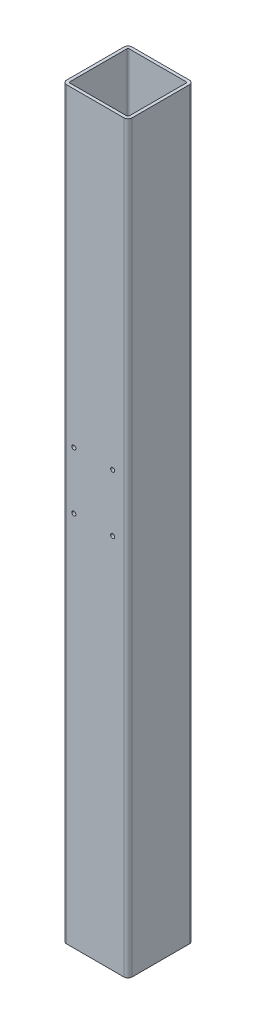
ISO-10303-21;
HEADER;
FILE_DESCRIPTION(('STEP AP214'),'2;1');
FILE_NAME('part.step','',(''),(''),'','','');
FILE_SCHEMA(('AUTOMOTIVE_DESIGN { 1 0 10303 214 1 1 1 1 }'));
ENDSEC;
DATA;
#1=APPLICATION_CONTEXT('core data for automotive mechanical design processes');
#2=APPLICATION_PROTOCOL_DEFINITION('international standard','automotive_design',2000,#1);
#3=PRODUCT_CONTEXT('',#1,'mechanical');
#4=PRODUCT('Part','Part','',(#3));
#5=PRODUCT_RELATED_PRODUCT_CATEGORY('part','',(#4));
#6=PRODUCT_DEFINITION_FORMATION('','',#4);
#7=PRODUCT_DEFINITION_CONTEXT('part definition',#1,'design');
#8=PRODUCT_DEFINITION('design','',#6,#7);
#9=PRODUCT_DEFINITION_SHAPE('','',#8);
#10=(LENGTH_UNIT() NAMED_UNIT(*) SI_UNIT(.MILLI.,.METRE.));
#11=(NAMED_UNIT(*) PLANE_ANGLE_UNIT() SI_UNIT($,.RADIAN.));
#12=(NAMED_UNIT(*) SI_UNIT($,.STERADIAN.) SOLID_ANGLE_UNIT());
#13=UNCERTAINTY_MEASURE_WITH_UNIT(LENGTH_MEASURE(1.E-05),#10,'distance_accuracy_value','');
#14=(GEOMETRIC_REPRESENTATION_CONTEXT(3) GLOBAL_UNCERTAINTY_ASSIGNED_CONTEXT((#13)) GLOBAL_UNIT_ASSIGNED_CONTEXT((#10,
#11,#12)) REPRESENTATION_CONTEXT('',''));
#15=CARTESIAN_POINT('',(0.,0.,0.));
#16=DIRECTION('',(0.,0.,1.));
#17=DIRECTION('',(1.,0.,0.));
#18=AXIS2_PLACEMENT_3D('',#15,#16,#17);
#19=CARTESIAN_POINT('',(26.9875000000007,6.7319110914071,38.1));
#20=DIRECTION('',(0.,0.,1.));
#21=DIRECTION('',(1.,0.,0.));
#22=AXIS2_PLACEMENT_3D('',#19,#20,#21);
#23=CYLINDRICAL_SURFACE('',#22,3.175);
#24=CARTESIAN_POINT('',(26.9875000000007,6.7319110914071,46.0375));
#25=DIRECTION('',(0.,0.,1.));
#26=DIRECTION('',(1.,0.,0.));
#27=AXIS2_PLACEMENT_3D('',#24,#25,#26);
#28=CIRCLE('',#27,3.175);
#29=CARTESIAN_POINT('',(30.1625000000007,6.7319110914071,46.0375));
#30=VERTEX_POINT('',#29);
#31=CARTESIAN_POINT('',(23.8125000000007,6.7319110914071,46.0375));
#32=VERTEX_POINT('',#31);
#33=EDGE_CURVE('E182',#30,#32,#28,.F.);
#34=ORIENTED_EDGE('',*,*,#33,.T.);
#35=DIRECTION('',(0.,0.,1.));
#36=VECTOR('',#35,1.);
#37=CARTESIAN_POINT('',(23.8125000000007,6.7319110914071,38.1));
#38=LINE('',#37,#36);
#39=CARTESIAN_POINT('',(23.8125000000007,6.7319110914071,50.8));
#40=VERTEX_POINT('',#39);
#41=EDGE_CURVE('E175',#32,#40,#38,.T.);
#42=ORIENTED_EDGE('',*,*,#41,.T.);
#43=CARTESIAN_POINT('',(26.9875000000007,6.7319110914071,50.8));
#44=DIRECTION('',(0.,0.,1.));
#45=DIRECTION('',(1.,0.,0.));
#46=AXIS2_PLACEMENT_3D('',#43,#44,#45);
#47=CIRCLE('',#46,3.175);
#48=CARTESIAN_POINT('',(30.1625000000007,6.7319110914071,50.8));
#49=VERTEX_POINT('',#48);
#50=EDGE_CURVE('E185',#49,#40,#47,.F.);
#51=ORIENTED_EDGE('',*,*,#50,.F.);
#52=DIRECTION('',(0.,0.,1.));
#53=VECTOR('',#52,1.);
#54=CARTESIAN_POINT('',(30.1625000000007,6.7319110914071,38.1));
#55=LINE('',#54,#53);
#56=EDGE_CURVE('E180',#49,#30,#55,.F.);
#57=ORIENTED_EDGE('',*,*,#56,.T.);
#58=EDGE_LOOP('',(#34,#42,#51,#57));
#59=FACE_BOUND('',#58,.T.);
#60=ADVANCED_FACE('F16',(#59),#23,.F.);
#61=CARTESIAN_POINT('',(26.9875000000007,6.7319110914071,38.1));
#62=DIRECTION('',(0.,0.,1.));
#63=DIRECTION('',(1.,0.,0.));
#64=AXIS2_PLACEMENT_3D('',#61,#62,#63);
#65=CYLINDRICAL_SURFACE('',#64,3.175);
#66=CARTESIAN_POINT('',(26.9875000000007,6.7319110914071,50.8));
#67=DIRECTION('',(0.,0.,1.));
#68=DIRECTION('',(1.,0.,0.));
#69=AXIS2_PLACEMENT_3D('',#66,#67,#68);
#70=CIRCLE('',#69,3.175);
#71=EDGE_CURVE('E214',#40,#49,#70,.F.);
#72=ORIENTED_EDGE('',*,*,#71,.F.);
#73=ORIENTED_EDGE('',*,*,#41,.F.);
#74=CARTESIAN_POINT('',(26.9875000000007,6.7319110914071,46.0375));
#75=DIRECTION('',(0.,0.,1.));
#76=DIRECTION('',(1.,0.,0.));
#77=AXIS2_PLACEMENT_3D('',#74,#75,#76);
#78=CIRCLE('',#77,3.175);
#79=EDGE_CURVE('E19',#32,#30,#78,.F.);
#80=ORIENTED_EDGE('',*,*,#79,.T.);
#81=ORIENTED_EDGE('',*,*,#56,.F.);
#82=EDGE_LOOP('',(#72,#73,#80,#81));
#83=FACE_BOUND('',#82,.T.);
#84=ADVANCED_FACE('F189',(#83),#65,.F.);
#85=CARTESIAN_POINT('',(-33.3374999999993,6.7319110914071,38.1));
#86=DIRECTION('',(0.,0.,1.));
#87=DIRECTION('',(1.,0.,0.));
#88=AXIS2_PLACEMENT_3D('',#85,#86,#87);
#89=CYLINDRICAL_SURFACE('',#88,3.175);
#90=CARTESIAN_POINT('',(-33.3374999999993,6.7319110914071,46.0375));
#91=DIRECTION('',(0.,0.,1.));
#92=DIRECTION('',(1.,0.,0.));
#93=AXIS2_PLACEMENT_3D('',#90,#91,#92);
#94=CIRCLE('',#93,3.175);
#95=CARTESIAN_POINT('',(-30.1624999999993,6.7319110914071,46.0375));
#96=VERTEX_POINT('',#95);
#97=CARTESIAN_POINT('',(-36.5124999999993,6.7319110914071,46.0375));
#98=VERTEX_POINT('',#97);
#99=EDGE_CURVE('E195',#96,#98,#94,.F.);
#100=ORIENTED_EDGE('',*,*,#99,.T.);
#101=DIRECTION('',(0.,0.,1.));
#102=VECTOR('',#101,1.);
#103=CARTESIAN_POINT('',(-36.5124999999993,6.7319110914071,38.1));
#104=LINE('',#103,#102);
#105=CARTESIAN_POINT('',(-36.5124999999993,6.7319110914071,50.8));
#106=VERTEX_POINT('',#105);
#107=EDGE_CURVE('E187',#98,#106,#104,.T.);
#108=ORIENTED_EDGE('',*,*,#107,.T.);
#109=CARTESIAN_POINT('',(-33.3374999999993,6.7319110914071,50.8));
#110=DIRECTION('',(0.,0.,1.));
#111=DIRECTION('',(1.,0.,0.));
#112=AXIS2_PLACEMENT_3D('',#109,#110,#111);
#113=CIRCLE('',#112,3.175);
#114=CARTESIAN_POINT('',(-30.1624999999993,6.7319110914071,50.8));
#115=VERTEX_POINT('',#114);
#116=EDGE_CURVE('E217',#115,#106,#113,.F.);
#117=ORIENTED_EDGE('',*,*,#116,.F.);
#118=DIRECTION('',(0.,0.,1.));
#119=VECTOR('',#118,1.);
#120=CARTESIAN_POINT('',(-30.1624999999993,6.7319110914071,38.1));
#121=LINE('',#120,#119);
#122=EDGE_CURVE('E294',#115,#96,#121,.F.);
#123=ORIENTED_EDGE('',*,*,#122,.T.);
#124=EDGE_LOOP('',(#100,#108,#117,#123));
#125=FACE_BOUND('',#124,.T.);
#126=ADVANCED_FACE('F610',(#125),#89,.F.);
#127=CARTESIAN_POINT('',(-33.3374999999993,6.7319110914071,38.1));
#128=DIRECTION('',(0.,0.,1.));
#129=DIRECTION('',(1.,0.,0.));
#130=AXIS2_PLACEMENT_3D('',#127,#128,#129);
#131=CYLINDRICAL_SURFACE('',#130,3.175);
#132=CARTESIAN_POINT('',(-33.3374999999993,6.7319110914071,50.8));
#133=DIRECTION('',(0.,0.,1.));
#134=DIRECTION('',(1.,0.,0.));
#135=AXIS2_PLACEMENT_3D('',#132,#133,#134);
#136=CIRCLE('',#135,3.175);
#137=EDGE_CURVE('E220',#106,#115,#136,.F.);
#138=ORIENTED_EDGE('',*,*,#137,.F.);
#139=ORIENTED_EDGE('',*,*,#107,.F.);
#140=CARTESIAN_POINT('',(-33.3374999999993,6.7319110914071,46.0375));
#141=DIRECTION('',(0.,0.,1.));
#142=DIRECTION('',(1.,0.,0.));
#143=AXIS2_PLACEMENT_3D('',#140,#141,#142);
#144=CIRCLE('',#143,3.175);
#145=EDGE_CURVE('E193',#98,#96,#144,.F.);
#146=ORIENTED_EDGE('',*,*,#145,.T.);
#147=ORIENTED_EDGE('',*,*,#122,.F.);
#148=EDGE_LOOP('',(#138,#139,#146,#147));
#149=FACE_BOUND('',#148,.T.);
#150=ADVANCED_FACE('F602',(#149),#131,.F.);
#151=CARTESIAN_POINT('',(-33.3374999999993,95.6319110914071,38.1));
#152=DIRECTION('',(0.,0.,1.));
#153=DIRECTION('',(1.,0.,0.));
#154=AXIS2_PLACEMENT_3D('',#151,#152,#153);
#155=CYLINDRICAL_SURFACE('',#154,3.175);
#156=CARTESIAN_POINT('',(-33.3374999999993,95.6319110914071,46.0375));
#157=DIRECTION('',(0.,0.,1.));
#158=DIRECTION('',(1.,0.,0.));
#159=AXIS2_PLACEMENT_3D('',#156,#157,#158);
#160=CIRCLE('',#159,3.175);
#161=CARTESIAN_POINT('',(-30.1624999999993,95.6319110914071,46.0375));
#162=VERTEX_POINT('',#161);
#163=CARTESIAN_POINT('',(-36.5124999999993,95.6319110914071,46.0375));
#164=VERTEX_POINT('',#163);
#165=EDGE_CURVE('E203',#162,#164,#160,.F.);
#166=ORIENTED_EDGE('',*,*,#165,.T.);
#167=DIRECTION('',(0.,0.,1.));
#168=VECTOR('',#167,1.);
#169=CARTESIAN_POINT('',(-36.5124999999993,95.6319110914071,38.1));
#170=LINE('',#169,#168);
#171=CARTESIAN_POINT('',(-36.5124999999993,95.6319110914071,50.8));
#172=VERTEX_POINT('',#171);
#173=EDGE_CURVE('E296',#164,#172,#170,.T.);
#174=ORIENTED_EDGE('',*,*,#173,.T.);
#175=CARTESIAN_POINT('',(-33.3374999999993,95.6319110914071,50.8));
#176=DIRECTION('',(0.,0.,1.));
#177=DIRECTION('',(1.,0.,0.));
#178=AXIS2_PLACEMENT_3D('',#175,#176,#177);
#179=CIRCLE('',#178,3.175);
#180=CARTESIAN_POINT('',(-30.1624999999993,95.6319110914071,50.8));
#181=VERTEX_POINT('',#180);
#182=EDGE_CURVE('E223',#181,#172,#179,.F.);
#183=ORIENTED_EDGE('',*,*,#182,.F.);
#184=DIRECTION('',(0.,0.,1.));
#185=VECTOR('',#184,1.);
#186=CARTESIAN_POINT('',(-30.1624999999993,95.6319110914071,38.1));
#187=LINE('',#186,#185);
#188=EDGE_CURVE('E298',#181,#162,#187,.F.);
#189=ORIENTED_EDGE('',*,*,#188,.T.);
#190=EDGE_LOOP('',(#166,#174,#183,#189));
#191=FACE_BOUND('',#190,.T.);
#192=ADVANCED_FACE('F594',(#191),#155,.F.);
#193=CARTESIAN_POINT('',(-33.3374999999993,95.6319110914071,38.1));
#194=DIRECTION('',(0.,0.,1.));
#195=DIRECTION('',(1.,0.,0.));
#196=AXIS2_PLACEMENT_3D('',#193,#194,#195);
#197=CYLINDRICAL_SURFACE('',#196,3.175);
#198=CARTESIAN_POINT('',(-33.3374999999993,95.6319110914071,50.8));
#199=DIRECTION('',(0.,0.,1.));
#200=DIRECTION('',(1.,0.,0.));
#201=AXIS2_PLACEMENT_3D('',#198,#199,#200);
#202=CIRCLE('',#201,3.175);
#203=EDGE_CURVE('E226',#172,#181,#202,.F.);
#204=ORIENTED_EDGE('',*,*,#203,.F.);
#205=ORIENTED_EDGE('',*,*,#173,.F.);
#206=CARTESIAN_POINT('',(-33.3374999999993,95.6319110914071,46.0375));
#207=DIRECTION('',(0.,0.,1.));
#208=DIRECTION('',(1.,0.,0.));
#209=AXIS2_PLACEMENT_3D('',#206,#207,#208);
#210=CIRCLE('',#209,3.175);
#211=EDGE_CURVE('E200',#164,#162,#210,.F.);
#212=ORIENTED_EDGE('',*,*,#211,.T.);
#213=ORIENTED_EDGE('',*,*,#188,.F.);
#214=EDGE_LOOP('',(#204,#205,#212,#213));
#215=FACE_BOUND('',#214,.T.);
#216=ADVANCED_FACE('F586',(#215),#197,.F.);
#217=CARTESIAN_POINT('',(26.9875000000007,95.6319110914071,38.1));
#218=DIRECTION('',(0.,0.,1.));
#219=DIRECTION('',(1.,0.,0.));
#220=AXIS2_PLACEMENT_3D('',#217,#218,#219);
#221=CYLINDRICAL_SURFACE('',#220,3.175);
#222=CARTESIAN_POINT('',(26.9875000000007,95.6319110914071,46.0375));
#223=DIRECTION('',(0.,0.,1.));
#224=DIRECTION('',(1.,0.,0.));
#225=AXIS2_PLACEMENT_3D('',#222,#223,#224);
#226=CIRCLE('',#225,3.175);
#227=CARTESIAN_POINT('',(30.1625000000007,95.6319110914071,46.0375));
#228=VERTEX_POINT('',#227);
#229=CARTESIAN_POINT('',(23.8125000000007,95.6319110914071,46.0375));
#230=VERTEX_POINT('',#229);
#231=EDGE_CURVE('E209',#228,#230,#226,.F.);
#232=ORIENTED_EDGE('',*,*,#231,.T.);
#233=DIRECTION('',(0.,0.,1.));
#234=VECTOR('',#233,1.);
#235=CARTESIAN_POINT('',(23.8125000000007,95.6319110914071,38.1));
#236=LINE('',#235,#234);
#237=CARTESIAN_POINT('',(23.8125000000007,95.6319110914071,50.8));
#238=VERTEX_POINT('',#237);
#239=EDGE_CURVE('E300',#230,#238,#236,.T.);
#240=ORIENTED_EDGE('',*,*,#239,.T.);
#241=CARTESIAN_POINT('',(26.9875000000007,95.6319110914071,50.8));
#242=DIRECTION('',(0.,0.,1.));
#243=DIRECTION('',(1.,0.,0.));
#244=AXIS2_PLACEMENT_3D('',#241,#242,#243);
#245=CIRCLE('',#244,3.175);
#246=CARTESIAN_POINT('',(30.1625000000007,95.6319110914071,50.8));
#247=VERTEX_POINT('',#246);
#248=EDGE_CURVE('E229',#247,#238,#245,.F.);
#249=ORIENTED_EDGE('',*,*,#248,.F.);
#250=DIRECTION('',(0.,0.,1.));
#251=VECTOR('',#250,1.);
#252=CARTESIAN_POINT('',(30.1625000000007,95.6319110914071,38.1));
#253=LINE('',#252,#251);
#254=EDGE_CURVE('E302',#247,#228,#253,.F.);
#255=ORIENTED_EDGE('',*,*,#254,.T.);
#256=EDGE_LOOP('',(#232,#240,#249,#255));
#257=FACE_BOUND('',#256,.T.);
#258=ADVANCED_FACE('F578',(#257),#221,.F.);
#259=CARTESIAN_POINT('',(26.9875000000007,95.6319110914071,38.1));
#260=DIRECTION('',(0.,0.,1.));
#261=DIRECTION('',(1.,0.,0.));
#262=AXIS2_PLACEMENT_3D('',#259,#260,#261);
#263=CYLINDRICAL_SURFACE('',#262,3.175);
#264=CARTESIAN_POINT('',(26.9875000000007,95.6319110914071,50.8));
#265=DIRECTION('',(0.,0.,1.));
#266=DIRECTION('',(1.,0.,0.));
#267=AXIS2_PLACEMENT_3D('',#264,#265,#266);
#268=CIRCLE('',#267,3.175);
#269=EDGE_CURVE('E232',#238,#247,#268,.F.);
#270=ORIENTED_EDGE('',*,*,#269,.F.);
#271=ORIENTED_EDGE('',*,*,#239,.F.);
#272=CARTESIAN_POINT('',(26.9875000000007,95.6319110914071,46.0375));
#273=DIRECTION('',(0.,0.,1.));
#274=DIRECTION('',(1.,0.,0.));
#275=AXIS2_PLACEMENT_3D('',#272,#273,#274);
#276=CIRCLE('',#275,3.175);
#277=EDGE_CURVE('E206',#230,#228,#276,.F.);
#278=ORIENTED_EDGE('',*,*,#277,.T.);
#279=ORIENTED_EDGE('',*,*,#254,.F.);
#280=EDGE_LOOP('',(#270,#271,#278,#279));
#281=FACE_BOUND('',#280,.T.);
#282=ADVANCED_FACE('F571',(#281),#263,.F.);
#283=CARTESIAN_POINT('',(-44.4500000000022,577.85,-44.45));
#284=DIRECTION('',(0.,-1.,0.));
#285=DIRECTION('',(0.,0.,-1.));
#286=AXIS2_PLACEMENT_3D('',#283,#284,#285);
#287=CYLINDRICAL_SURFACE('',#286,1.5875);
#288=DIRECTION('',(0.,1.,0.));
#289=VECTOR('',#288,1.);
#290=CARTESIAN_POINT('',(-44.4500000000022,577.85,-46.0375));
#291=LINE('',#290,#289);
#292=CARTESIAN_POINT('',(-44.4500000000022,-577.85,-46.0375));
#293=VERTEX_POINT('',#292);
#294=CARTESIAN_POINT('',(-44.4500000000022,577.85,-46.0375));
#295=VERTEX_POINT('',#294);
#296=EDGE_CURVE('E304',#293,#295,#291,.T.);
#297=ORIENTED_EDGE('',*,*,#296,.T.);
#298=CARTESIAN_POINT('',(-44.4500000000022,577.85,-44.45));
#299=DIRECTION('',(0.,-1.,0.));
#300=DIRECTION('',(0.,0.,-1.));
#301=AXIS2_PLACEMENT_3D('',#298,#299,#300);
#302=CIRCLE('',#301,1.5875);
#303=CARTESIAN_POINT('',(-46.0375000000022,577.85,-44.45));
#304=VERTEX_POINT('',#303);
#305=EDGE_CURVE('E260',#304,#295,#302,.T.);
#306=ORIENTED_EDGE('',*,*,#305,.F.);
#307=DIRECTION('',(0.,1.,0.));
#308=VECTOR('',#307,1.);
#309=CARTESIAN_POINT('',(-46.0375000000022,577.85,-44.45));
#310=LINE('',#309,#308);
#311=CARTESIAN_POINT('',(-46.0375000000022,-577.85,-44.45));
#312=VERTEX_POINT('',#311);
#313=EDGE_CURVE('E320',#304,#312,#310,.F.);
#314=ORIENTED_EDGE('',*,*,#313,.T.);
#315=CARTESIAN_POINT('',(-44.4500000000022,-577.85,-44.45));
#316=DIRECTION('',(0.,-1.,0.));
#317=DIRECTION('',(0.,0.,-1.));
#318=AXIS2_PLACEMENT_3D('',#315,#316,#317);
#319=CIRCLE('',#318,1.5875);
#320=EDGE_CURVE('E246',#312,#293,#319,.T.);
#321=ORIENTED_EDGE('',*,*,#320,.T.);
#322=EDGE_LOOP('',(#297,#306,#314,#321));
#323=FACE_BOUND('',#322,.T.);
#324=ADVANCED_FACE('F452',(#323),#287,.F.);
#325=CARTESIAN_POINT('',(44.4500000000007,577.85,-46.0375));
#326=DIRECTION('',(0.,0.,-1.));
#327=DIRECTION('',(-1.,0.,0.));
#328=AXIS2_PLACEMENT_3D('',#325,#326,#327);
#329=PLANE('',#328);
#330=DIRECTION('',(0.,-1.,0.));
#331=VECTOR('',#330,1.);
#332=CARTESIAN_POINT('',(44.4500000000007,577.85,-46.0374999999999));
#333=LINE('',#332,#331);
#334=CARTESIAN_POINT('',(44.4500000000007,-577.85,-46.0375));
#335=VERTEX_POINT('',#334);
#336=CARTESIAN_POINT('',(44.4500000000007,577.85,-46.0375));
#337=VERTEX_POINT('',#336);
#338=EDGE_CURVE('E308',#335,#337,#333,.F.);
#339=ORIENTED_EDGE('',*,*,#338,.T.);
#340=DIRECTION('',(1.,0.,0.));
#341=VECTOR('',#340,1.);
#342=CARTESIAN_POINT('',(7.21911419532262E-13,577.85,-46.0375));
#343=LINE('',#342,#341);
#344=EDGE_CURVE('E263',#295,#337,#343,.T.);
#345=ORIENTED_EDGE('',*,*,#344,.F.);
#346=ORIENTED_EDGE('',*,*,#296,.F.);
#347=DIRECTION('',(1.,0.,0.));
#348=VECTOR('',#347,1.);
#349=CARTESIAN_POINT('',(-44.4500000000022,-577.85,-46.0375));
#350=LINE('',#349,#348);
#351=EDGE_CURVE('E239',#293,#335,#350,.T.);
#352=ORIENTED_EDGE('',*,*,#351,.T.);
#353=EDGE_LOOP('',(#339,#345,#346,#352));
#354=FACE_BOUND('',#353,.T.);
#355=ADVANCED_FACE('F449',(#354),#329,.F.);
#356=CARTESIAN_POINT('',(44.4500000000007,577.85,-44.45));
#357=DIRECTION('',(0.,-1.,0.));
#358=DIRECTION('',(0.,0.,-1.));
#359=AXIS2_PLACEMENT_3D('',#356,#357,#358);
#360=CYLINDRICAL_SURFACE('',#359,1.58749999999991);
#361=DIRECTION('',(0.,1.,0.));
#362=VECTOR('',#361,1.);
#363=CARTESIAN_POINT('',(46.0375000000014,577.85,-44.45));
#364=LINE('',#363,#362);
#365=CARTESIAN_POINT('',(46.0375000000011,-577.85,-44.45));
#366=VERTEX_POINT('',#365);
#367=CARTESIAN_POINT('',(46.0375000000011,577.85,-44.45));
#368=VERTEX_POINT('',#367);
#369=EDGE_CURVE('E311',#366,#368,#364,.T.);
#370=ORIENTED_EDGE('',*,*,#369,.T.);
#371=CARTESIAN_POINT('',(44.4500000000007,577.85,-44.45));
#372=DIRECTION('',(0.,-1.,0.));
#373=DIRECTION('',(0.,0.,-1.));
#374=AXIS2_PLACEMENT_3D('',#371,#372,#373);
#375=CIRCLE('',#374,1.58749999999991);
#376=EDGE_CURVE('E264',#337,#368,#375,.T.);
#377=ORIENTED_EDGE('',*,*,#376,.F.);
#378=ORIENTED_EDGE('',*,*,#338,.F.);
#379=CARTESIAN_POINT('',(44.4500000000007,-577.85,-44.45));
#380=DIRECTION('',(0.,-1.,0.));
#381=DIRECTION('',(0.,0.,-1.));
#382=AXIS2_PLACEMENT_3D('',#379,#380,#381);
#383=CIRCLE('',#382,1.58749999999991);
#384=EDGE_CURVE('E236',#335,#366,#383,.T.);
#385=ORIENTED_EDGE('',*,*,#384,.T.);
#386=EDGE_LOOP('',(#370,#377,#378,#385));
#387=FACE_BOUND('',#386,.T.);
#388=ADVANCED_FACE('F446',(#387),#360,.F.);
#389=CARTESIAN_POINT('',(46.0375000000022,577.85,44.45));
#390=DIRECTION('',(1.,0.,0.));
#391=DIRECTION('',(0.,0.,-1.));
#392=AXIS2_PLACEMENT_3D('',#389,#390,#391);
#393=PLANE('',#392);
#394=DIRECTION('',(0.,-1.,0.));
#395=VECTOR('',#394,1.);
#396=CARTESIAN_POINT('',(46.0375000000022,577.85,44.45));
#397=LINE('',#396,#395);
#398=CARTESIAN_POINT('',(46.0375000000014,-577.85,44.45));
#399=VERTEX_POINT('',#398);
#400=CARTESIAN_POINT('',(46.0375000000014,577.85,44.45));
#401=VERTEX_POINT('',#400);
#402=EDGE_CURVE('E191',#399,#401,#397,.F.);
#403=ORIENTED_EDGE('',*,*,#402,.T.);
#404=DIRECTION('',(0.,0.,1.));
#405=VECTOR('',#404,1.);
#406=CARTESIAN_POINT('',(46.0375000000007,577.85,0.));
#407=LINE('',#406,#405);
#408=EDGE_CURVE('E267',#368,#401,#407,.T.);
#409=ORIENTED_EDGE('',*,*,#408,.F.);
#410=ORIENTED_EDGE('',*,*,#369,.F.);
#411=DIRECTION('',(0.,0.,1.));
#412=VECTOR('',#411,1.);
#413=CARTESIAN_POINT('',(46.0375000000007,-577.85,-50.8));
#414=LINE('',#413,#412);
#415=EDGE_CURVE('E238',#366,#399,#414,.T.);
#416=ORIENTED_EDGE('',*,*,#415,.T.);
#417=EDGE_LOOP('',(#403,#409,#410,#416));
#418=FACE_BOUND('',#417,.T.);
#419=ADVANCED_FACE('F442',(#418),#393,.F.);
#420=CARTESIAN_POINT('',(44.4500000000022,577.85,44.45));
#421=DIRECTION('',(0.,-1.,0.));
#422=DIRECTION('',(0.,0.,-1.));
#423=AXIS2_PLACEMENT_3D('',#420,#421,#422);
#424=CYLINDRICAL_SURFACE('',#423,1.5875);
#425=DIRECTION('',(0.,1.,0.));
#426=VECTOR('',#425,1.);
#427=CARTESIAN_POINT('',(44.4500000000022,577.85,46.0375));
#428=LINE('',#427,#426);
#429=CARTESIAN_POINT('',(44.4500000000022,-577.85,46.0375));
#430=VERTEX_POINT('',#429);
#431=CARTESIAN_POINT('',(44.4500000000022,577.85,46.0375));
#432=VERTEX_POINT('',#431);
#433=EDGE_CURVE('E212',#430,#432,#428,.T.);
#434=ORIENTED_EDGE('',*,*,#433,.T.);
#435=CARTESIAN_POINT('',(44.4500000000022,577.85,44.45));
#436=DIRECTION('',(0.,-1.,0.));
#437=DIRECTION('',(0.,0.,-1.));
#438=AXIS2_PLACEMENT_3D('',#435,#436,#437);
#439=CIRCLE('',#438,1.5875);
#440=EDGE_CURVE('E268',#401,#432,#439,.T.);
#441=ORIENTED_EDGE('',*,*,#440,.F.);
#442=ORIENTED_EDGE('',*,*,#402,.F.);
#443=CARTESIAN_POINT('',(44.4500000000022,-577.85,44.45));
#444=DIRECTION('',(0.,-1.,0.));
#445=DIRECTION('',(0.,0.,-1.));
#446=AXIS2_PLACEMENT_3D('',#443,#444,#445);
#447=CIRCLE('',#446,1.5875);
#448=EDGE_CURVE('E240',#399,#430,#447,.T.);
#449=ORIENTED_EDGE('',*,*,#448,.T.);
#450=EDGE_LOOP('',(#434,#441,#442,#449));
#451=FACE_BOUND('',#450,.T.);
#452=ADVANCED_FACE('F438',(#451),#424,.F.);
#453=CARTESIAN_POINT('',(-44.4500000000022,577.85,46.0375));
#454=DIRECTION('',(0.,0.,1.));
#455=DIRECTION('',(1.,0.,0.));
#456=AXIS2_PLACEMENT_3D('',#453,#454,#455);
#457=PLANE('',#456);
#458=DIRECTION('',(0.,-1.,0.));
#459=VECTOR('',#458,1.);
#460=CARTESIAN_POINT('',(-44.4500000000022,577.85,46.0374999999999));
#461=LINE('',#460,#459);
#462=CARTESIAN_POINT('',(-44.4500000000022,-577.85,46.0375));
#463=VERTEX_POINT('',#462);
#464=CARTESIAN_POINT('',(-44.4500000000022,577.85,46.0375));
#465=VERTEX_POINT('',#464);
#466=EDGE_CURVE('E316',#463,#465,#461,.F.);
#467=ORIENTED_EDGE('',*,*,#466,.T.);
#468=DIRECTION('',(1.,0.,0.));
#469=VECTOR('',#468,1.);
#470=CARTESIAN_POINT('',(7.21911419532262E-13,577.85,46.0375));
#471=LINE('',#470,#469);
#472=EDGE_CURVE('E271',#432,#465,#471,.F.);
#473=ORIENTED_EDGE('',*,*,#472,.F.);
#474=ORIENTED_EDGE('',*,*,#433,.F.);
#475=DIRECTION('',(1.,0.,0.));
#476=VECTOR('',#475,1.);
#477=CARTESIAN_POINT('',(-44.4500000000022,-577.85,46.0375));
#478=LINE('',#477,#476);
#479=EDGE_CURVE('E242',#430,#463,#478,.F.);
#480=ORIENTED_EDGE('',*,*,#479,.T.);
#481=EDGE_LOOP('',(#467,#473,#474,#480));
#482=FACE_BOUND('',#481,.T.);
#483=ORIENTED_EDGE('',*,*,#277,.F.);
#484=ORIENTED_EDGE('',*,*,#231,.F.);
#485=EDGE_LOOP('',(#483,#484));
#486=FACE_BOUND('',#485,.T.);
#487=ORIENTED_EDGE('',*,*,#211,.F.);
#488=ORIENTED_EDGE('',*,*,#165,.F.);
#489=EDGE_LOOP('',(#487,#488));
#490=FACE_BOUND('',#489,.T.);
#491=ORIENTED_EDGE('',*,*,#145,.F.);
#492=ORIENTED_EDGE('',*,*,#99,.F.);
#493=EDGE_LOOP('',(#491,#492));
#494=FACE_BOUND('',#493,.T.);
#495=ORIENTED_EDGE('',*,*,#79,.F.);
#496=ORIENTED_EDGE('',*,*,#33,.F.);
#497=EDGE_LOOP('',(#495,#496));
#498=FACE_BOUND('',#497,.T.);
#499=ADVANCED_FACE('F192',(#482,#486,#490,#494,#498),#457,.F.);
#500=CARTESIAN_POINT('',(-44.4500000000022,577.85,44.45));
#501=DIRECTION('',(0.,-1.,0.));
#502=DIRECTION('',(0.,0.,-1.));
#503=AXIS2_PLACEMENT_3D('',#500,#501,#502);
#504=CYLINDRICAL_SURFACE('',#503,1.58749999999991);
#505=DIRECTION('',(0.,1.,0.));
#506=VECTOR('',#505,1.);
#507=CARTESIAN_POINT('',(-46.0375000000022,577.85,44.45));
#508=LINE('',#507,#506);
#509=CARTESIAN_POINT('',(-46.0375000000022,-577.85,44.45));
#510=VERTEX_POINT('',#509);
#511=CARTESIAN_POINT('',(-46.0375000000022,577.85,44.45));
#512=VERTEX_POINT('',#511);
#513=EDGE_CURVE('E319',#510,#512,#508,.T.);
#514=ORIENTED_EDGE('',*,*,#513,.T.);
#515=CARTESIAN_POINT('',(-44.4500000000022,577.85,44.45));
#516=DIRECTION('',(0.,-1.,0.));
#517=DIRECTION('',(0.,0.,-1.));
#518=AXIS2_PLACEMENT_3D('',#515,#516,#517);
#519=CIRCLE('',#518,1.58749999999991);
#520=EDGE_CURVE('E272',#465,#512,#519,.T.);
#521=ORIENTED_EDGE('',*,*,#520,.F.);
#522=ORIENTED_EDGE('',*,*,#466,.F.);
#523=CARTESIAN_POINT('',(-44.4500000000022,-577.85,44.45));
#524=DIRECTION('',(0.,-1.,0.));
#525=DIRECTION('',(0.,0.,-1.));
#526=AXIS2_PLACEMENT_3D('',#523,#524,#525);
#527=CIRCLE('',#526,1.58749999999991);
#528=EDGE_CURVE('E243',#463,#510,#527,.T.);
#529=ORIENTED_EDGE('',*,*,#528,.T.);
#530=EDGE_LOOP('',(#514,#521,#522,#529));
#531=FACE_BOUND('',#530,.T.);
#532=ADVANCED_FACE('F427',(#531),#504,.F.);
#533=CARTESIAN_POINT('',(-46.0375000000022,577.85,-44.45));
#534=DIRECTION('',(-1.,0.,0.));
#535=DIRECTION('',(0.,0.,1.));
#536=AXIS2_PLACEMENT_3D('',#533,#534,#535);
#537=PLANE('',#536);
#538=ORIENTED_EDGE('',*,*,#313,.F.);
#539=DIRECTION('',(0.,0.,1.));
#540=VECTOR('',#539,1.);
#541=CARTESIAN_POINT('',(-46.0375000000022,577.85,0.));
#542=LINE('',#541,#540);
#543=EDGE_CURVE('E275',#512,#304,#542,.F.);
#544=ORIENTED_EDGE('',*,*,#543,.F.);
#545=ORIENTED_EDGE('',*,*,#513,.F.);
#546=DIRECTION('',(0.,0.,1.));
#547=VECTOR('',#546,1.);
#548=CARTESIAN_POINT('',(-46.0375000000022,-577.85,-50.8));
#549=LINE('',#548,#547);
#550=EDGE_CURVE('E245',#510,#312,#549,.F.);
#551=ORIENTED_EDGE('',*,*,#550,.T.);
#552=EDGE_LOOP('',(#538,#544,#545,#551));
#553=FACE_BOUND('',#552,.T.);
#554=ADVANCED_FACE('F423',(#553),#537,.F.);
#555=CARTESIAN_POINT('',(-50.8000000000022,577.85,-44.45));
#556=DIRECTION('',(-1.,0.,0.));
#557=DIRECTION('',(0.,0.,1.));
#558=AXIS2_PLACEMENT_3D('',#555,#556,#557);
#559=PLANE('',#558);
#560=DIRECTION('',(0.,0.,1.));
#561=VECTOR('',#560,1.);
#562=CARTESIAN_POINT('',(-50.8000000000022,577.85,0.));
#563=LINE('',#562,#561);
#564=CARTESIAN_POINT('',(-50.8000000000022,577.85,-44.45));
#565=VERTEX_POINT('',#564);
#566=CARTESIAN_POINT('',(-50.8000000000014,577.85,44.45));
#567=VERTEX_POINT('',#566);
#568=EDGE_CURVE('E279',#565,#567,#563,.T.);
#569=ORIENTED_EDGE('',*,*,#568,.F.);
#570=DIRECTION('',(0.,-1.,0.));
#571=VECTOR('',#570,1.);
#572=CARTESIAN_POINT('',(-50.8000000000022,577.85,-44.45));
#573=LINE('',#572,#571);
#574=CARTESIAN_POINT('',(-50.8000000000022,-577.85,-44.45));
#575=VERTEX_POINT('',#574);
#576=EDGE_CURVE('E259',#575,#565,#573,.F.);
#577=ORIENTED_EDGE('',*,*,#576,.F.);
#578=DIRECTION('',(0.,0.,1.));
#579=VECTOR('',#578,1.);
#580=CARTESIAN_POINT('',(-50.8000000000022,-577.85,-50.8));
#581=LINE('',#580,#579);
#582=CARTESIAN_POINT('',(-50.8000000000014,-577.85,44.45));
#583=VERTEX_POINT('',#582);
#584=EDGE_CURVE('E249',#575,#583,#581,.T.);
#585=ORIENTED_EDGE('',*,*,#584,.T.);
#586=DIRECTION('',(0.,-1.,0.));
#587=VECTOR('',#586,1.);
#588=CARTESIAN_POINT('',(-50.8000000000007,577.85,44.45));
#589=LINE('',#588,#587);
#590=EDGE_CURVE('E215',#567,#583,#589,.T.);
#591=ORIENTED_EDGE('',*,*,#590,.F.);
#592=EDGE_LOOP('',(#569,#577,#585,#591));
#593=FACE_BOUND('',#592,.T.);
#594=ADVANCED_FACE('F397',(#593),#559,.T.);
#595=CARTESIAN_POINT('',(-44.4500000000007,577.85,44.45));
#596=DIRECTION('',(0.,-1.,0.));
#597=DIRECTION('',(0.,0.,-1.));
#598=AXIS2_PLACEMENT_3D('',#595,#596,#597);
#599=CYLINDRICAL_SURFACE('',#598,6.35);
#600=CARTESIAN_POINT('',(-44.4500000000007,577.85,44.45));
#601=DIRECTION('',(0.,-1.,0.));
#602=DIRECTION('',(0.,0.,-1.));
#603=AXIS2_PLACEMENT_3D('',#600,#601,#602);
#604=CIRCLE('',#603,6.35);
#605=CARTESIAN_POINT('',(-44.4500000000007,577.85,50.8));
#606=VERTEX_POINT('',#605);
#607=EDGE_CURVE('E280',#567,#606,#604,.F.);
#608=ORIENTED_EDGE('',*,*,#607,.F.);
#609=ORIENTED_EDGE('',*,*,#590,.T.);
#610=CARTESIAN_POINT('',(-44.4500000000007,-577.85,44.45));
#611=DIRECTION('',(0.,-1.,0.));
#612=DIRECTION('',(0.,0.,-1.));
#613=AXIS2_PLACEMENT_3D('',#610,#611,#612);
#614=CIRCLE('',#613,6.35);
#615=CARTESIAN_POINT('',(-44.4500000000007,-577.85,50.8));
#616=VERTEX_POINT('',#615);
#617=EDGE_CURVE('E250',#583,#616,#614,.F.);
#618=ORIENTED_EDGE('',*,*,#617,.T.);
#619=DIRECTION('',(0.,1.,0.));
#620=VECTOR('',#619,1.);
#621=CARTESIAN_POINT('',(-44.4500000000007,577.85,50.8));
#622=LINE('',#621,#620);
#623=EDGE_CURVE('E235',#606,#616,#622,.F.);
#624=ORIENTED_EDGE('',*,*,#623,.F.);
#625=EDGE_LOOP('',(#608,#609,#618,#624));
#626=FACE_BOUND('',#625,.T.);
#627=ADVANCED_FACE('F401',(#626),#599,.T.);
#628=CARTESIAN_POINT('',(-44.4500000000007,577.85,50.8));
#629=DIRECTION('',(0.,0.,1.));
#630=DIRECTION('',(1.,0.,0.));
#631=AXIS2_PLACEMENT_3D('',#628,#629,#630);
#632=PLANE('',#631);
#633=DIRECTION('',(1.,0.,0.));
#634=VECTOR('',#633,1.);
#635=CARTESIAN_POINT('',(7.21911419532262E-13,577.85,50.8));
#636=LINE('',#635,#634);
#637=CARTESIAN_POINT('',(44.4500000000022,577.85,50.8));
#638=VERTEX_POINT('',#637);
#639=EDGE_CURVE('E283',#606,#638,#636,.T.);
#640=ORIENTED_EDGE('',*,*,#639,.F.);
#641=ORIENTED_EDGE('',*,*,#623,.T.);
#642=DIRECTION('',(1.,0.,0.));
#643=VECTOR('',#642,1.);
#644=CARTESIAN_POINT('',(-44.4500000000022,-577.85,50.8));
#645=LINE('',#644,#643);
#646=CARTESIAN_POINT('',(44.4500000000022,-577.85,50.8));
#647=VERTEX_POINT('',#646);
#648=EDGE_CURVE('E252',#616,#647,#645,.T.);
#649=ORIENTED_EDGE('',*,*,#648,.T.);
#650=DIRECTION('',(0.,-1.,0.));
#651=VECTOR('',#650,1.);
#652=CARTESIAN_POINT('',(44.4500000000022,577.85,50.8));
#653=LINE('',#652,#651);
#654=EDGE_CURVE('E333',#638,#647,#653,.T.);
#655=ORIENTED_EDGE('',*,*,#654,.F.);
#656=EDGE_LOOP('',(#640,#641,#649,#655));
#657=FACE_BOUND('',#656,.T.);
#658=ORIENTED_EDGE('',*,*,#248,.T.);
#659=ORIENTED_EDGE('',*,*,#269,.T.);
#660=EDGE_LOOP('',(#658,#659));
#661=FACE_BOUND('',#660,.T.);
#662=ORIENTED_EDGE('',*,*,#182,.T.);
#663=ORIENTED_EDGE('',*,*,#203,.T.);
#664=EDGE_LOOP('',(#662,#663));
#665=FACE_BOUND('',#664,.T.);
#666=ORIENTED_EDGE('',*,*,#116,.T.);
#667=ORIENTED_EDGE('',*,*,#137,.T.);
#668=EDGE_LOOP('',(#666,#667));
#669=FACE_BOUND('',#668,.T.);
#670=ORIENTED_EDGE('',*,*,#50,.T.);
#671=ORIENTED_EDGE('',*,*,#71,.T.);
#672=EDGE_LOOP('',(#670,#671));
#673=FACE_BOUND('',#672,.T.);
#674=ADVANCED_FACE('F404',(#657,#661,#665,#669,#673),#632,.T.);
#675=CARTESIAN_POINT('',(44.4500000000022,577.85,44.45));
#676=DIRECTION('',(0.,-1.,0.));
#677=DIRECTION('',(0.,0.,-1.));
#678=AXIS2_PLACEMENT_3D('',#675,#676,#677);
#679=CYLINDRICAL_SURFACE('',#678,6.35);
#680=CARTESIAN_POINT('',(44.4500000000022,577.85,44.45));
#681=DIRECTION('',(0.,-1.,0.));
#682=DIRECTION('',(0.,0.,-1.));
#683=AXIS2_PLACEMENT_3D('',#680,#681,#682);
#684=CIRCLE('',#683,6.35);
#685=CARTESIAN_POINT('',(50.8000000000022,577.85,44.45));
#686=VERTEX_POINT('',#685);
#687=EDGE_CURVE('E284',#638,#686,#684,.F.);
#688=ORIENTED_EDGE('',*,*,#687,.F.);
#689=ORIENTED_EDGE('',*,*,#654,.T.);
#690=CARTESIAN_POINT('',(44.4500000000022,-577.85,44.45));
#691=DIRECTION('',(0.,-1.,0.));
#692=DIRECTION('',(0.,0.,-1.));
#693=AXIS2_PLACEMENT_3D('',#690,#691,#692);
#694=CIRCLE('',#693,6.35);
#695=CARTESIAN_POINT('',(50.8000000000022,-577.85,44.45));
#696=VERTEX_POINT('',#695);
#697=EDGE_CURVE('E253',#647,#696,#694,.F.);
#698=ORIENTED_EDGE('',*,*,#697,.T.);
#699=DIRECTION('',(0.,1.,0.));
#700=VECTOR('',#699,1.);
#701=CARTESIAN_POINT('',(50.8000000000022,577.85,44.45));
#702=LINE('',#701,#700);
#703=EDGE_CURVE('E336',#686,#696,#702,.F.);
#704=ORIENTED_EDGE('',*,*,#703,.F.);
#705=EDGE_LOOP('',(#688,#689,#698,#704));
#706=FACE_BOUND('',#705,.T.);
#707=ADVANCED_FACE('F409',(#706),#679,.T.);
#708=CARTESIAN_POINT('',(50.8000000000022,577.85,44.45));
#709=DIRECTION('',(1.,0.,0.));
#710=DIRECTION('',(0.,0.,-1.));
#711=AXIS2_PLACEMENT_3D('',#708,#709,#710);
#712=PLANE('',#711);
#713=DIRECTION('',(0.,0.,1.));
#714=VECTOR('',#713,1.);
#715=CARTESIAN_POINT('',(50.8000000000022,577.85,0.));
#716=LINE('',#715,#714);
#717=CARTESIAN_POINT('',(50.8000000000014,577.85,-44.45));
#718=VERTEX_POINT('',#717);
#719=EDGE_CURVE('E287',#686,#718,#716,.F.);
#720=ORIENTED_EDGE('',*,*,#719,.F.);
#721=ORIENTED_EDGE('',*,*,#703,.T.);
#722=DIRECTION('',(0.,0.,1.));
#723=VECTOR('',#722,1.);
#724=CARTESIAN_POINT('',(50.8000000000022,-577.85,-50.8));
#725=LINE('',#724,#723);
#726=CARTESIAN_POINT('',(50.8000000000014,-577.85,-44.45));
#727=VERTEX_POINT('',#726);
#728=EDGE_CURVE('E255',#696,#727,#725,.F.);
#729=ORIENTED_EDGE('',*,*,#728,.T.);
#730=DIRECTION('',(0.,-1.,0.));
#731=VECTOR('',#730,1.);
#732=CARTESIAN_POINT('',(50.8000000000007,577.85,-44.45));
#733=LINE('',#732,#731);
#734=EDGE_CURVE('E291',#718,#727,#733,.T.);
#735=ORIENTED_EDGE('',*,*,#734,.F.);
#736=EDGE_LOOP('',(#720,#721,#729,#735));
#737=FACE_BOUND('',#736,.T.);
#738=ADVANCED_FACE('F384',(#737),#712,.T.);
#739=CARTESIAN_POINT('',(-44.4500000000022,-577.85,-50.8));
#740=DIRECTION('',(0.,1.,0.));
#741=DIRECTION('',(0.,0.,1.));
#742=AXIS2_PLACEMENT_3D('',#739,#740,#741);
#743=PLANE('',#742);
#744=DIRECTION('',(-1.,0.,0.));
#745=VECTOR('',#744,1.);
#746=CARTESIAN_POINT('',(44.4500000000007,-577.85,-50.8));
#747=LINE('',#746,#745);
#748=CARTESIAN_POINT('',(44.4500000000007,-577.85,-50.8));
#749=VERTEX_POINT('',#748);
#750=CARTESIAN_POINT('',(-44.4500000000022,-577.85,-50.8));
#751=VERTEX_POINT('',#750);
#752=EDGE_CURVE('E342',#749,#751,#747,.T.);
#753=ORIENTED_EDGE('',*,*,#752,.F.);
#754=CARTESIAN_POINT('',(44.4500000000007,-577.85,-44.45));
#755=DIRECTION('',(0.,-1.,0.));
#756=DIRECTION('',(0.,0.,-1.));
#757=AXIS2_PLACEMENT_3D('',#754,#755,#756);
#758=CIRCLE('',#757,6.35);
#759=EDGE_CURVE('E288',#727,#749,#758,.F.);
#760=ORIENTED_EDGE('',*,*,#759,.F.);
#761=ORIENTED_EDGE('',*,*,#728,.F.);
#762=ORIENTED_EDGE('',*,*,#697,.F.);
#763=ORIENTED_EDGE('',*,*,#648,.F.);
#764=ORIENTED_EDGE('',*,*,#617,.F.);
#765=ORIENTED_EDGE('',*,*,#584,.F.);
#766=CARTESIAN_POINT('',(-44.4500000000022,-577.85,-44.45));
#767=DIRECTION('',(0.,-1.,0.));
#768=DIRECTION('',(0.,0.,-1.));
#769=AXIS2_PLACEMENT_3D('',#766,#767,#768);
#770=CIRCLE('',#769,6.35);
#771=EDGE_CURVE('E256',#751,#575,#770,.F.);
#772=ORIENTED_EDGE('',*,*,#771,.F.);
#773=EDGE_LOOP('',(#753,#760,#761,#762,#763,#764,#765,#772));
#774=FACE_BOUND('',#773,.T.);
#775=ORIENTED_EDGE('',*,*,#550,.F.);
#776=ORIENTED_EDGE('',*,*,#528,.F.);
#777=ORIENTED_EDGE('',*,*,#479,.F.);
#778=ORIENTED_EDGE('',*,*,#448,.F.);
#779=ORIENTED_EDGE('',*,*,#415,.F.);
#780=ORIENTED_EDGE('',*,*,#384,.F.);
#781=ORIENTED_EDGE('',*,*,#351,.F.);
#782=ORIENTED_EDGE('',*,*,#320,.F.);
#783=EDGE_LOOP('',(#775,#776,#777,#778,#779,#780,#781,#782));
#784=FACE_BOUND('',#783,.T.);
#785=ADVANCED_FACE('F411',(#774,#784),#743,.F.);
#786=CARTESIAN_POINT('',(-44.4500000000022,577.85,-44.45));
#787=DIRECTION('',(0.,-1.,0.));
#788=DIRECTION('',(0.,0.,-1.));
#789=AXIS2_PLACEMENT_3D('',#786,#787,#788);
#790=CYLINDRICAL_SURFACE('',#789,6.35);
#791=CARTESIAN_POINT('',(-44.4500000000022,577.85,-44.45));
#792=DIRECTION('',(0.,-1.,0.));
#793=DIRECTION('',(0.,0.,-1.));
#794=AXIS2_PLACEMENT_3D('',#791,#792,#793);
#795=CIRCLE('',#794,6.35);
#796=CARTESIAN_POINT('',(-44.4500000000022,577.85,-50.8));
#797=VERTEX_POINT('',#796);
#798=EDGE_CURVE('E276',#797,#565,#795,.F.);
#799=ORIENTED_EDGE('',*,*,#798,.F.);
#800=DIRECTION('',(0.,1.,0.));
#801=VECTOR('',#800,1.);
#802=CARTESIAN_POINT('',(-44.4500000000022,577.85,-50.8));
#803=LINE('',#802,#801);
#804=EDGE_CURVE('E352',#751,#797,#803,.T.);
#805=ORIENTED_EDGE('',*,*,#804,.F.);
#806=ORIENTED_EDGE('',*,*,#771,.T.);
#807=ORIENTED_EDGE('',*,*,#576,.T.);
#808=EDGE_LOOP('',(#799,#805,#806,#807));
#809=FACE_BOUND('',#808,.T.);
#810=ADVANCED_FACE('F394',(#809),#790,.T.);
#811=CARTESIAN_POINT('',(7.21911419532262E-13,577.85,0.));
#812=DIRECTION('',(0.,1.,0.));
#813=DIRECTION('',(0.,0.,1.));
#814=AXIS2_PLACEMENT_3D('',#811,#812,#813);
#815=PLANE('',#814);
#816=ORIENTED_EDGE('',*,*,#719,.T.);
#817=CARTESIAN_POINT('',(44.4500000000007,577.85,-44.45));
#818=DIRECTION('',(0.,-1.,0.));
#819=DIRECTION('',(0.,0.,-1.));
#820=AXIS2_PLACEMENT_3D('',#817,#818,#819);
#821=CIRCLE('',#820,6.35);
#822=CARTESIAN_POINT('',(44.4500000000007,577.85,-50.8));
#823=VERTEX_POINT('',#822);
#824=EDGE_CURVE('E35',#823,#718,#821,.T.);
#825=ORIENTED_EDGE('',*,*,#824,.F.);
#826=DIRECTION('',(-1.,0.,0.));
#827=VECTOR('',#826,1.);
#828=CARTESIAN_POINT('',(44.4500000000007,577.85,-50.8));
#829=LINE('',#828,#827);
#830=EDGE_CURVE('E26',#797,#823,#829,.F.);
#831=ORIENTED_EDGE('',*,*,#830,.F.);
#832=ORIENTED_EDGE('',*,*,#798,.T.);
#833=ORIENTED_EDGE('',*,*,#568,.T.);
#834=ORIENTED_EDGE('',*,*,#607,.T.);
#835=ORIENTED_EDGE('',*,*,#639,.T.);
#836=ORIENTED_EDGE('',*,*,#687,.T.);
#837=EDGE_LOOP('',(#816,#825,#831,#832,#833,#834,#835,#836));
#838=FACE_BOUND('',#837,.T.);
#839=ORIENTED_EDGE('',*,*,#520,.T.);
#840=ORIENTED_EDGE('',*,*,#543,.T.);
#841=ORIENTED_EDGE('',*,*,#305,.T.);
#842=ORIENTED_EDGE('',*,*,#344,.T.);
#843=ORIENTED_EDGE('',*,*,#376,.T.);
#844=ORIENTED_EDGE('',*,*,#408,.T.);
#845=ORIENTED_EDGE('',*,*,#440,.T.);
#846=ORIENTED_EDGE('',*,*,#472,.T.);
#847=EDGE_LOOP('',(#839,#840,#841,#842,#843,#844,#845,#846));
#848=FACE_BOUND('',#847,.T.);
#849=ADVANCED_FACE('F380',(#838,#848),#815,.T.);
#850=CARTESIAN_POINT('',(44.4500000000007,577.85,-44.45));
#851=DIRECTION('',(0.,-1.,0.));
#852=DIRECTION('',(0.,0.,-1.));
#853=AXIS2_PLACEMENT_3D('',#850,#851,#852);
#854=CYLINDRICAL_SURFACE('',#853,6.35);
#855=ORIENTED_EDGE('',*,*,#824,.T.);
#856=ORIENTED_EDGE('',*,*,#734,.T.);
#857=ORIENTED_EDGE('',*,*,#759,.T.);
#858=DIRECTION('',(0.,1.,0.));
#859=VECTOR('',#858,1.);
#860=CARTESIAN_POINT('',(44.4500000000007,577.85,-50.8));
#861=LINE('',#860,#859);
#862=EDGE_CURVE('E11',#823,#749,#861,.F.);
#863=ORIENTED_EDGE('',*,*,#862,.F.);
#864=EDGE_LOOP('',(#855,#856,#857,#863));
#865=FACE_BOUND('',#864,.T.);
#866=ADVANCED_FACE('F388',(#865),#854,.T.);
#867=CARTESIAN_POINT('',(44.4500000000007,577.85,-50.8));
#868=DIRECTION('',(0.,0.,-1.));
#869=DIRECTION('',(-1.,0.,0.));
#870=AXIS2_PLACEMENT_3D('',#867,#868,#869);
#871=PLANE('',#870);
#872=ORIENTED_EDGE('',*,*,#830,.T.);
#873=ORIENTED_EDGE('',*,*,#862,.T.);
#874=ORIENTED_EDGE('',*,*,#752,.T.);
#875=ORIENTED_EDGE('',*,*,#804,.T.);
#876=EDGE_LOOP('',(#872,#873,#874,#875));
#877=FACE_BOUND('',#876,.T.);
#878=ADVANCED_FACE('F390',(#877),#871,.T.);
#879=CLOSED_SHELL('',(#60,#84,#126,#150,#192,#216,#258,#282,#324,#355,#388,#419,#452,#499,#532,
#554,#594,#627,#674,#707,#738,#785,#810,#849,#866,#878));
#880=MANIFOLD_SOLID_BREP('B1',#879);
#881=ADVANCED_BREP_SHAPE_REPRESENTATION('',(#18,#880),#14);
#882=SHAPE_DEFINITION_REPRESENTATION(#9,#881);
ENDSEC;
END-ISO-10303-21;
